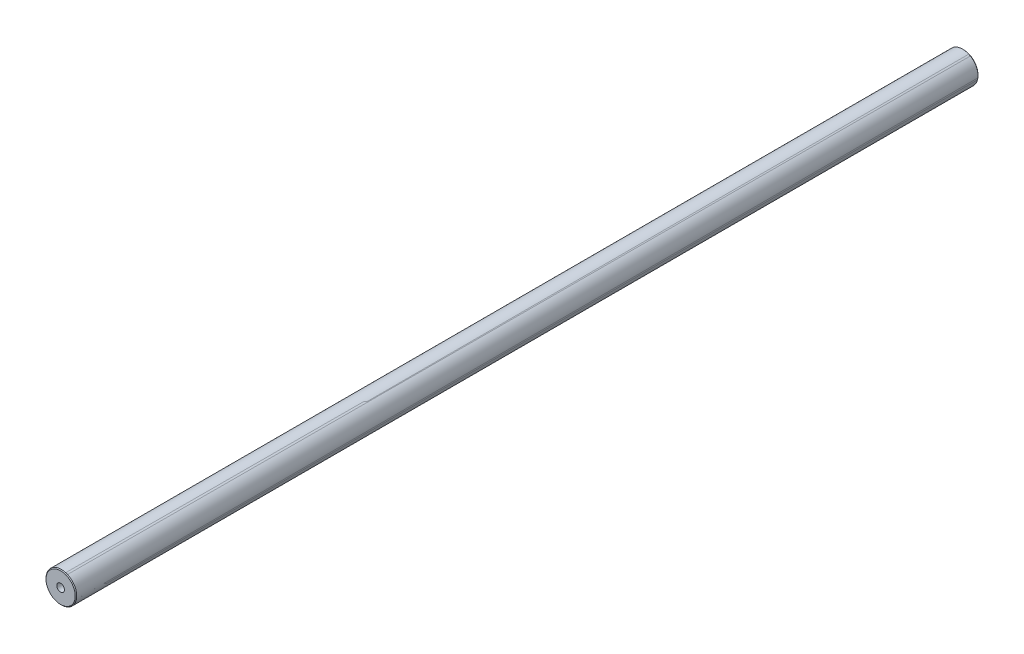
ISO-10303-21;
HEADER;
FILE_DESCRIPTION(('STEP AP214'),'2;1');
FILE_NAME('part.step','',(''),(''),'','','');
FILE_SCHEMA(('AUTOMOTIVE_DESIGN { 1 0 10303 214 1 1 1 1 }'));
ENDSEC;
DATA;
#1=APPLICATION_CONTEXT('core data for automotive mechanical design processes');
#2=APPLICATION_PROTOCOL_DEFINITION('international standard','automotive_design',2000,#1);
#3=PRODUCT_CONTEXT('',#1,'mechanical');
#4=PRODUCT('Part','Part','',(#3));
#5=PRODUCT_RELATED_PRODUCT_CATEGORY('part','',(#4));
#6=PRODUCT_DEFINITION_FORMATION('','',#4);
#7=PRODUCT_DEFINITION_CONTEXT('part definition',#1,'design');
#8=PRODUCT_DEFINITION('design','',#6,#7);
#9=PRODUCT_DEFINITION_SHAPE('','',#8);
#10=(LENGTH_UNIT() NAMED_UNIT(*) SI_UNIT(.MILLI.,.METRE.));
#11=(NAMED_UNIT(*) PLANE_ANGLE_UNIT() SI_UNIT($,.RADIAN.));
#12=(NAMED_UNIT(*) SI_UNIT($,.STERADIAN.) SOLID_ANGLE_UNIT());
#13=UNCERTAINTY_MEASURE_WITH_UNIT(LENGTH_MEASURE(1.E-05),#10,'distance_accuracy_value','');
#14=(GEOMETRIC_REPRESENTATION_CONTEXT(3) GLOBAL_UNCERTAINTY_ASSIGNED_CONTEXT((#13)) GLOBAL_UNIT_ASSIGNED_CONTEXT((#10,
#11,#12)) REPRESENTATION_CONTEXT('',''));
#15=CARTESIAN_POINT('',(0.,0.,0.));
#16=DIRECTION('',(0.,0.,1.));
#17=DIRECTION('',(1.,0.,0.));
#18=AXIS2_PLACEMENT_3D('',#15,#16,#17);
#19=CARTESIAN_POINT('',(-46.093752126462,-6.875000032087,-1144.));
#20=DIRECTION('',(0.,0.,1.));
#21=DIRECTION('',(1.,0.,0.));
#22=AXIS2_PLACEMENT_3D('',#19,#20,#21);
#23=PLANE('',#22);
#24=CARTESIAN_POINT('',(-41.093752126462,-1.875000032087,-1144.));
#25=DIRECTION('',(0.,0.,-1.));
#26=DIRECTION('',(-1.,0.,0.));
#27=AXIS2_PLACEMENT_3D('',#24,#25,#26);
#28=CIRCLE('',#27,5.);
#29=CARTESIAN_POINT('',(-46.093752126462,-1.875000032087,-1144.));
#30=VERTEX_POINT('',#29);
#31=EDGE_CURVE('P0_E350',#30,#30,#28,.F.);
#32=ORIENTED_EDGE('',*,*,#31,.F.);
#33=EDGE_LOOP('',(#32));
#34=FACE_BOUND('',#33,.T.);
#35=ADVANCED_FACE('P0_F346',(#34),#23,.F.);
#36=CARTESIAN_POINT('',(-41.093752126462,-1.875000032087,-1144.));
#37=DIRECTION('',(0.,0.,-1.));
#38=DIRECTION('',(-1.,0.,0.));
#39=AXIS2_PLACEMENT_3D('',#36,#37,#38);
#40=CYLINDRICAL_SURFACE('',#39,5.);
#41=ORIENTED_EDGE('',*,*,#31,.T.);
#42=EDGE_LOOP('',(#41));
#43=FACE_BOUND('',#42,.T.);
#44=CARTESIAN_POINT('',(-41.093752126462,-1.875000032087,-1174.));
#45=DIRECTION('',(0.,0.,-1.));
#46=DIRECTION('',(-1.,0.,0.));
#47=AXIS2_PLACEMENT_3D('',#44,#45,#46);
#48=CIRCLE('',#47,5.);
#49=CARTESIAN_POINT('',(-46.093752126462,-1.875000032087,-1174.));
#50=VERTEX_POINT('',#49);
#51=EDGE_CURVE('P0_E370',#50,#50,#48,.F.);
#52=ORIENTED_EDGE('',*,*,#51,.F.);
#53=EDGE_LOOP('',(#52));
#54=FACE_BOUND('',#53,.T.);
#55=ADVANCED_FACE('P0_F377',(#43,#54),#40,.F.);
#56=CARTESIAN_POINT('',(-16.0712047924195,-26.8975473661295,-1174.));
#57=DIRECTION('',(0.,0.,-1.));
#58=DIRECTION('',(-1.,0.,0.));
#59=AXIS2_PLACEMENT_3D('',#56,#57,#58);
#60=PLANE('',#59);
#61=ORIENTED_EDGE('',*,*,#51,.T.);
#62=EDGE_LOOP('',(#61));
#63=FACE_BOUND('',#62,.T.);
#64=CARTESIAN_POINT('',(-41.093752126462,-1.875000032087,-1174.));
#65=DIRECTION('',(0.,0.,1.));
#66=DIRECTION('',(1.,0.,0.));
#67=AXIS2_PLACEMENT_3D('',#64,#65,#66);
#68=CIRCLE('',#67,19.);
#69=CARTESIAN_POINT('',(-22.093752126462,-1.875000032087,-1174.));
#70=VERTEX_POINT('',#69);
#71=EDGE_CURVE('P0_E367',#70,#70,#68,.F.);
#72=ORIENTED_EDGE('',*,*,#71,.T.);
#73=EDGE_LOOP('',(#72));
#74=FACE_BOUND('',#73,.T.);
#75=ADVANCED_FACE('P0_F385',(#63,#74),#60,.T.);
#76=CARTESIAN_POINT('',(-41.093752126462,-1.875000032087,-1174.));
#77=DIRECTION('',(0.,0.,1.));
#78=DIRECTION('',(1.,0.,0.));
#79=AXIS2_PLACEMENT_3D('',#76,#77,#78);
#80=CONICAL_SURFACE('',#79,19.,0.785398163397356);
#81=ORIENTED_EDGE('',*,*,#71,.F.);
#82=EDGE_LOOP('',(#81));
#83=FACE_BOUND('',#82,.T.);
#84=CARTESIAN_POINT('',(-41.093752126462,-1.875000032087,-1173.));
#85=DIRECTION('',(0.,0.,1.));
#86=DIRECTION('',(0.400818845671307,0.916157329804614,0.));
#87=AXIS2_PLACEMENT_3D('',#84,#85,#86);
#88=CIRCLE('',#87,19.9999999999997);
#89=CARTESIAN_POINT('',(-33.077375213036,16.448146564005,-1173.));
#90=VERTEX_POINT('',#89);
#91=EDGE_CURVE('P0_E369',#90,#90,#88,.F.);
#92=ORIENTED_EDGE('',*,*,#91,.T.);
#93=EDGE_LOOP('',(#92));
#94=FACE_BOUND('',#93,.T.);
#95=ADVANCED_FACE('P0_F412',(#83,#94),#80,.T.);
#96=CARTESIAN_POINT('',(-41.093752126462,-1.875000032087,-1173.));
#97=DIRECTION('',(0.,0.,1.));
#98=DIRECTION('',(1.,0.,0.));
#99=AXIS2_PLACEMENT_3D('',#96,#97,#98);
#100=CYLINDRICAL_SURFACE('',#99,19.9999999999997);
#101=ORIENTED_EDGE('',*,*,#91,.F.);
#102=EDGE_LOOP('',(#101));
#103=FACE_BOUND('',#102,.T.);
#104=CARTESIAN_POINT('',(-41.093752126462,-1.875000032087,-1.));
#105=DIRECTION('',(0.,0.,1.));
#106=DIRECTION('',(0.400818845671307,0.916157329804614,0.));
#107=AXIS2_PLACEMENT_3D('',#104,#105,#106);
#108=CIRCLE('',#107,19.9999999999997);
#109=CARTESIAN_POINT('',(-33.077375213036,16.448146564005,-1.));
#110=VERTEX_POINT('',#109);
#111=EDGE_CURVE('P0_E362',#110,#110,#108,.F.);
#112=ORIENTED_EDGE('',*,*,#111,.T.);
#113=EDGE_LOOP('',(#112));
#114=FACE_BOUND('',#113,.T.);
#115=ADVANCED_FACE('P0_F406',(#103,#114),#100,.T.);
#116=CARTESIAN_POINT('',(-36.093752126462,-6.875000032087,-30.));
#117=DIRECTION('',(0.,0.,-1.));
#118=DIRECTION('',(-1.,0.,0.));
#119=AXIS2_PLACEMENT_3D('',#116,#117,#118);
#120=PLANE('',#119);
#121=CARTESIAN_POINT('',(-41.093752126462,-1.875000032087,-30.));
#122=DIRECTION('',(0.,0.,1.));
#123=DIRECTION('',(0.,-1.,0.));
#124=AXIS2_PLACEMENT_3D('',#121,#122,#123);
#125=CIRCLE('',#124,5.);
#126=CARTESIAN_POINT('',(-41.093752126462,-6.875000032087,-30.));
#127=VERTEX_POINT('',#126);
#128=EDGE_CURVE('P0_E359',#127,#127,#125,.F.);
#129=ORIENTED_EDGE('',*,*,#128,.F.);
#130=EDGE_LOOP('',(#129));
#131=FACE_BOUND('',#130,.T.);
#132=ADVANCED_FACE('P0_F400',(#131),#120,.F.);
#133=CARTESIAN_POINT('',(-41.093752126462,-1.875000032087,-1.));
#134=DIRECTION('',(0.,0.,-1.));
#135=DIRECTION('',(-1.,0.,0.));
#136=AXIS2_PLACEMENT_3D('',#133,#134,#135);
#137=CONICAL_SURFACE('',#136,19.9999999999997,0.785398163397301);
#138=ORIENTED_EDGE('',*,*,#111,.F.);
#139=EDGE_LOOP('',(#138));
#140=FACE_BOUND('',#139,.T.);
#141=CARTESIAN_POINT('',(-41.093752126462,-1.875000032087,0.));
#142=DIRECTION('',(0.,0.,-1.));
#143=DIRECTION('',(-1.,0.,0.));
#144=AXIS2_PLACEMENT_3D('',#141,#142,#143);
#145=CIRCLE('',#144,19.);
#146=CARTESIAN_POINT('',(-60.093752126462,-1.875000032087,0.));
#147=VERTEX_POINT('',#146);
#148=EDGE_CURVE('P0_E354',#147,#147,#145,.F.);
#149=ORIENTED_EDGE('',*,*,#148,.F.);
#150=EDGE_LOOP('',(#149));
#151=FACE_BOUND('',#150,.T.);
#152=ADVANCED_FACE('P0_F394',(#140,#151),#137,.T.);
#153=CARTESIAN_POINT('',(-41.093752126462,-1.875000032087,-30.));
#154=DIRECTION('',(0.,0.,1.));
#155=DIRECTION('',(0.,-1.,0.));
#156=AXIS2_PLACEMENT_3D('',#153,#154,#155);
#157=CYLINDRICAL_SURFACE('',#156,5.);
#158=ORIENTED_EDGE('',*,*,#128,.T.);
#159=EDGE_LOOP('',(#158));
#160=FACE_BOUND('',#159,.T.);
#161=CARTESIAN_POINT('',(-41.093752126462,-1.87500003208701,0.));
#162=DIRECTION('',(0.,0.,1.));
#163=DIRECTION('',(0.,-1.,0.));
#164=AXIS2_PLACEMENT_3D('',#161,#162,#163);
#165=CIRCLE('',#164,5.);
#166=CARTESIAN_POINT('',(-41.093752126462,-6.87500003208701,0.));
#167=VERTEX_POINT('',#166);
#168=EDGE_CURVE('P0_E10',#167,#167,#165,.F.);
#169=ORIENTED_EDGE('',*,*,#168,.F.);
#170=EDGE_LOOP('',(#169));
#171=FACE_BOUND('',#170,.T.);
#172=ADVANCED_FACE('P0_F390',(#160,#171),#157,.F.);
#173=CARTESIAN_POINT('',(-66.1162994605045,-26.8975473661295,0.));
#174=DIRECTION('',(0.,0.,1.));
#175=DIRECTION('',(1.,0.,0.));
#176=AXIS2_PLACEMENT_3D('',#173,#174,#175);
#177=PLANE('',#176);
#178=ORIENTED_EDGE('',*,*,#168,.T.);
#179=EDGE_LOOP('',(#178));
#180=FACE_BOUND('',#179,.T.);
#181=ORIENTED_EDGE('',*,*,#148,.T.);
#182=EDGE_LOOP('',(#181));
#183=FACE_BOUND('',#182,.T.);
#184=ADVANCED_FACE('P0_F348',(#180,#183),#177,.T.);
#185=CLOSED_SHELL('',(#35,#55,#75,#95,#115,#132,#152,#172,#184));
#186=MANIFOLD_SOLID_BREP('P0_B2',#185);
#187=CARTESIAN_POINT('',(-46.093752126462,-6.875000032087,-1144.));
#188=DIRECTION('',(0.,0.,1.));
#189=DIRECTION('',(1.,0.,0.));
#190=AXIS2_PLACEMENT_3D('',#187,#188,#189);
#191=PLANE('',#190);
#192=CARTESIAN_POINT('',(-41.093752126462,-1.875000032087,-1144.));
#193=DIRECTION('',(0.,0.,-1.));
#194=DIRECTION('',(-1.,0.,0.));
#195=AXIS2_PLACEMENT_3D('',#192,#193,#194);
#196=CIRCLE('',#195,5.);
#197=CARTESIAN_POINT('',(-46.093752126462,-1.875000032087,-1144.));
#198=VERTEX_POINT('',#197);
#199=EDGE_CURVE('P1_E17',#198,#198,#196,.F.);
#200=ORIENTED_EDGE('',*,*,#199,.F.);
#201=EDGE_LOOP('',(#200));
#202=FACE_BOUND('',#201,.T.);
#203=ADVANCED_FACE('P1_F13',(#202),#191,.F.);
#204=CARTESIAN_POINT('',(-41.093752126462,-1.875000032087,-1144.));
#205=DIRECTION('',(0.,0.,-1.));
#206=DIRECTION('',(-1.,0.,0.));
#207=AXIS2_PLACEMENT_3D('',#204,#205,#206);
#208=CYLINDRICAL_SURFACE('',#207,5.);
#209=ORIENTED_EDGE('',*,*,#199,.T.);
#210=EDGE_LOOP('',(#209));
#211=FACE_BOUND('',#210,.T.);
#212=CARTESIAN_POINT('',(-41.093752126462,-1.875000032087,-1174.));
#213=DIRECTION('',(0.,0.,-1.));
#214=DIRECTION('',(-1.,0.,0.));
#215=AXIS2_PLACEMENT_3D('',#212,#213,#214);
#216=CIRCLE('',#215,5.);
#217=CARTESIAN_POINT('',(-46.093752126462,-1.875000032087,-1174.));
#218=VERTEX_POINT('',#217);
#219=EDGE_CURVE('P1_E37',#218,#218,#216,.F.);
#220=ORIENTED_EDGE('',*,*,#219,.F.);
#221=EDGE_LOOP('',(#220));
#222=FACE_BOUND('',#221,.T.);
#223=ADVANCED_FACE('P1_F44',(#211,#222),#208,.F.);
#224=CARTESIAN_POINT('',(-16.0712047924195,-26.8975473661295,-1174.));
#225=DIRECTION('',(0.,0.,-1.));
#226=DIRECTION('',(-1.,0.,0.));
#227=AXIS2_PLACEMENT_3D('',#224,#225,#226);
#228=PLANE('',#227);
#229=ORIENTED_EDGE('',*,*,#219,.T.);
#230=EDGE_LOOP('',(#229));
#231=FACE_BOUND('',#230,.T.);
#232=CARTESIAN_POINT('',(-41.093752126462,-1.875000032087,-1174.));
#233=DIRECTION('',(0.,0.,1.));
#234=DIRECTION('',(1.,0.,0.));
#235=AXIS2_PLACEMENT_3D('',#232,#233,#234);
#236=CIRCLE('',#235,19.);
#237=CARTESIAN_POINT('',(-22.093752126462,-1.875000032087,-1174.));
#238=VERTEX_POINT('',#237);
#239=EDGE_CURVE('P1_E34',#238,#238,#236,.F.);
#240=ORIENTED_EDGE('',*,*,#239,.T.);
#241=EDGE_LOOP('',(#240));
#242=FACE_BOUND('',#241,.T.);
#243=ADVANCED_FACE('P1_F52',(#231,#242),#228,.T.);
#244=CARTESIAN_POINT('',(-41.093752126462,-1.875000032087,-1174.));
#245=DIRECTION('',(0.,0.,1.));
#246=DIRECTION('',(1.,0.,0.));
#247=AXIS2_PLACEMENT_3D('',#244,#245,#246);
#248=CONICAL_SURFACE('',#247,19.,0.785398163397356);
#249=ORIENTED_EDGE('',*,*,#239,.F.);
#250=EDGE_LOOP('',(#249));
#251=FACE_BOUND('',#250,.T.);
#252=CARTESIAN_POINT('',(-41.093752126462,-1.875000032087,-1173.));
#253=DIRECTION('',(0.,0.,1.));
#254=DIRECTION('',(0.400818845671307,0.916157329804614,0.));
#255=AXIS2_PLACEMENT_3D('',#252,#253,#254);
#256=CIRCLE('',#255,19.9999999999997);
#257=CARTESIAN_POINT('',(-33.077375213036,16.448146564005,-1173.));
#258=VERTEX_POINT('',#257);
#259=EDGE_CURVE('P1_E36',#258,#258,#256,.F.);
#260=ORIENTED_EDGE('',*,*,#259,.T.);
#261=EDGE_LOOP('',(#260));
#262=FACE_BOUND('',#261,.T.);
#263=ADVANCED_FACE('P1_F77',(#251,#262),#248,.T.);
#264=CARTESIAN_POINT('',(-41.093752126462,-1.875000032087,-1173.));
#265=DIRECTION('',(0.,0.,1.));
#266=DIRECTION('',(1.,0.,0.));
#267=AXIS2_PLACEMENT_3D('',#264,#265,#266);
#268=CYLINDRICAL_SURFACE('',#267,19.9999999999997);
#269=ORIENTED_EDGE('',*,*,#259,.F.);
#270=EDGE_LOOP('',(#269));
#271=FACE_BOUND('',#270,.T.);
#272=CARTESIAN_POINT('',(-41.093752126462,-1.875000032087,-1.));
#273=DIRECTION('',(0.,0.,1.));
#274=DIRECTION('',(0.400818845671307,0.916157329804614,0.));
#275=AXIS2_PLACEMENT_3D('',#272,#273,#274);
#276=CIRCLE('',#275,19.9999999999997);
#277=CARTESIAN_POINT('',(-33.077375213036,16.448146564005,-1.));
#278=VERTEX_POINT('',#277);
#279=EDGE_CURVE('P1_E29',#278,#278,#276,.F.);
#280=ORIENTED_EDGE('',*,*,#279,.T.);
#281=EDGE_LOOP('',(#280));
#282=FACE_BOUND('',#281,.T.);
#283=ADVANCED_FACE('P1_F71',(#271,#282),#268,.T.);
#284=CARTESIAN_POINT('',(-36.093752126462,-6.875000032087,-30.));
#285=DIRECTION('',(0.,0.,-1.));
#286=DIRECTION('',(-1.,0.,0.));
#287=AXIS2_PLACEMENT_3D('',#284,#285,#286);
#288=PLANE('',#287);
#289=CARTESIAN_POINT('',(-41.093752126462,-1.875000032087,-30.));
#290=DIRECTION('',(0.,0.,1.));
#291=DIRECTION('',(0.,-1.,0.));
#292=AXIS2_PLACEMENT_3D('',#289,#290,#291);
#293=CIRCLE('',#292,5.);
#294=CARTESIAN_POINT('',(-41.093752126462,-6.875000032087,-30.));
#295=VERTEX_POINT('',#294);
#296=EDGE_CURVE('P1_E26',#295,#295,#293,.F.);
#297=ORIENTED_EDGE('',*,*,#296,.F.);
#298=EDGE_LOOP('',(#297));
#299=FACE_BOUND('',#298,.T.);
#300=ADVANCED_FACE('P1_F66',(#299),#288,.F.);
#301=CARTESIAN_POINT('',(-41.093752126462,-1.875000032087,-1.));
#302=DIRECTION('',(0.,0.,-1.));
#303=DIRECTION('',(-1.,0.,0.));
#304=AXIS2_PLACEMENT_3D('',#301,#302,#303);
#305=CONICAL_SURFACE('',#304,19.9999999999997,0.785398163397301);
#306=ORIENTED_EDGE('',*,*,#279,.F.);
#307=EDGE_LOOP('',(#306));
#308=FACE_BOUND('',#307,.T.);
#309=CARTESIAN_POINT('',(-41.093752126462,-1.875000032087,0.));
#310=DIRECTION('',(0.,0.,-1.));
#311=DIRECTION('',(-1.,0.,0.));
#312=AXIS2_PLACEMENT_3D('',#309,#310,#311);
#313=CIRCLE('',#312,19.);
#314=CARTESIAN_POINT('',(-60.093752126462,-1.875000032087,0.));
#315=VERTEX_POINT('',#314);
#316=EDGE_CURVE('P1_E21',#315,#315,#313,.F.);
#317=ORIENTED_EDGE('',*,*,#316,.F.);
#318=EDGE_LOOP('',(#317));
#319=FACE_BOUND('',#318,.T.);
#320=ADVANCED_FACE('P1_F60',(#308,#319),#305,.T.);
#321=CARTESIAN_POINT('',(-41.093752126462,-1.875000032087,-30.));
#322=DIRECTION('',(0.,0.,1.));
#323=DIRECTION('',(0.,-1.,0.));
#324=AXIS2_PLACEMENT_3D('',#321,#322,#323);
#325=CYLINDRICAL_SURFACE('',#324,5.);
#326=ORIENTED_EDGE('',*,*,#296,.T.);
#327=EDGE_LOOP('',(#326));
#328=FACE_BOUND('',#327,.T.);
#329=CARTESIAN_POINT('',(-41.093752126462,-1.87500003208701,0.));
#330=DIRECTION('',(0.,0.,1.));
#331=DIRECTION('',(0.,-1.,0.));
#332=AXIS2_PLACEMENT_3D('',#329,#330,#331);
#333=CIRCLE('',#332,5.);
#334=CARTESIAN_POINT('',(-41.093752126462,-6.87500003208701,0.));
#335=VERTEX_POINT('',#334);
#336=EDGE_CURVE('P1_E9',#335,#335,#333,.F.);
#337=ORIENTED_EDGE('',*,*,#336,.F.);
#338=EDGE_LOOP('',(#337));
#339=FACE_BOUND('',#338,.T.);
#340=ADVANCED_FACE('P1_F57',(#328,#339),#325,.F.);
#341=CARTESIAN_POINT('',(-66.1162994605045,-26.8975473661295,0.));
#342=DIRECTION('',(0.,0.,1.));
#343=DIRECTION('',(1.,0.,0.));
#344=AXIS2_PLACEMENT_3D('',#341,#342,#343);
#345=PLANE('',#344);
#346=ORIENTED_EDGE('',*,*,#336,.T.);
#347=EDGE_LOOP('',(#346));
#348=FACE_BOUND('',#347,.T.);
#349=ORIENTED_EDGE('',*,*,#316,.T.);
#350=EDGE_LOOP('',(#349));
#351=FACE_BOUND('',#350,.T.);
#352=ADVANCED_FACE('P1_F15',(#348,#351),#345,.T.);
#353=CLOSED_SHELL('',(#203,#223,#243,#263,#283,#300,#320,#340,#352));
#354=MANIFOLD_SOLID_BREP('P1_B1',#353);
#355=ADVANCED_BREP_SHAPE_REPRESENTATION('',(#18,#186,#354),#14);
#356=SHAPE_DEFINITION_REPRESENTATION(#9,#355);
ENDSEC;
END-ISO-10303-21;
